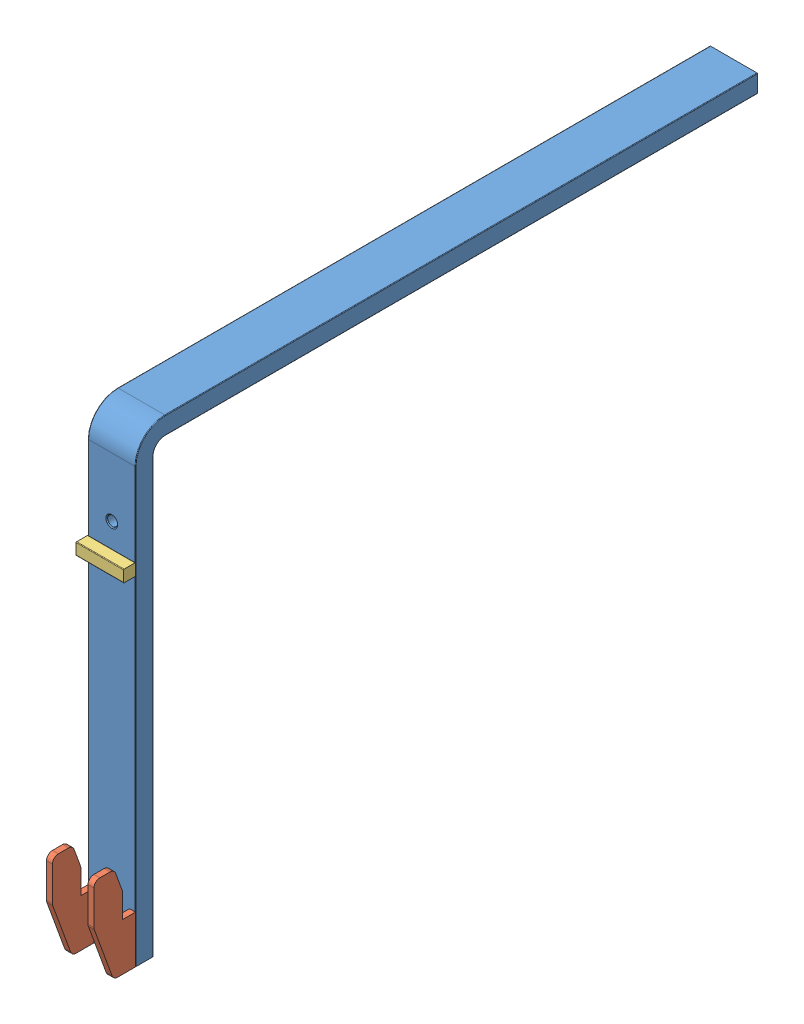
SolidWorks assembly FOURCHE ASM.sldasm, configuration Défaut (file format 7000). Lengths in mm.
Overall size (40 390 560).
4 component instances, 3 part files, 9 mates.
Components (placement in the parent):
- PLAT FOURCHE-1: PLAT FOURCHE.SLDPRT [Défaut] at (8.2616 54.347 49.8827) x (0 0 1) z (0 -1 0) size (525 40 390)
- ACCROCHE FOURCHE-1: ACCROCHE FOURCHE.SLDPRT [Défaut] at (-9.2384 -295.653 49.8827) x (0 0 1) z (0 -1 0) size (35 5 80)
- ACCROCHE FOURCHE-2: ACCROCHE FOURCHE.SLDPRT [Défaut] at (25.7616 -295.653 49.8827) x (0 0 1) z (0 -1 0) size (35 5 80)
- BUTEE FOURCHE-1: BUTEE FOURCHE.SLDPRT [Défaut] at (8.2616 -45.653 54.8827) x (0 1 0) z (0 0 -1) size (10 40 10)
Mates (geometry in assembly coordinates):
- Coïncidente1: coincident aligned: plane of PLAT FOURCHE-1 through (28.2616 -335.653 -475.1173) normal (0 -1 0); plane of ACCROCHE FOURCHE-1 through (-6.7384 -335.653 49.8827) normal (0 -1 0)
- Coïncidente2: coincident aligned: plane of PLAT FOURCHE-1 through (28.2616 -335.653 -475.1173) normal (0 -1 0); plane of ACCROCHE FOURCHE-2 through (28.2616 -335.653 49.8827) normal (0 -1 0)
- Coïncidente3: coincident anti-aligned: plane of PLAT FOURCHE-1 through (28.2616 -335.653 49.8827) normal (0 0 1); plane of ACCROCHE FOURCHE-1 through (-6.7384 -295.653 49.8827) normal (0 0 -1)
- Coïncidente4: coincident anti-aligned: plane of PLAT FOURCHE-1 through (28.2616 -335.653 49.8827) normal (0 0 1); plane of ACCROCHE FOURCHE-2 through (28.2616 -295.653 49.8827) normal (0 0 -1)
- Coïncidente5: coincident aligned: plane of PLAT FOURCHE-1 through (28.2616 54.347 49.8827) normal (1 0 0); plane of ACCROCHE FOURCHE-2 through (28.2616 -330.653 64.8827) normal (1 0 0)
- Coïncidente6: coincident aligned: plane of PLAT FOURCHE-1 through (-11.7384 54.347 49.8827) normal (-1 0 0); plane of ACCROCHE FOURCHE-1 through (-11.7384 -330.653 64.8827) normal (-1 0 0)
- Coïncidente7: coincident anti-aligned: plane of PLAT FOURCHE-1 through (28.2616 -335.653 49.8827) normal (0 0 1); plane of BUTEE FOURCHE-1 through (-11.7384 -50.153 49.8827) normal (0 0 -1)
- Coïncidente8: coincident aligned: plane of PLAT FOURCHE-1 through (-11.7384 54.347 49.8827) normal (-1 0 0); plane of BUTEE FOURCHE-1 through (-11.7384 -50.153 50.3827) normal (-1 0 0)
- Distance1: distance = 285 mm aligned: plane of BUTEE FOURCHE-1 through (-11.7384 -50.653 59.3827) normal (0 -1 0); plane of PLAT FOURCHE-1 through (28.2616 -335.653 -475.1173) normal (0 -1 0)
